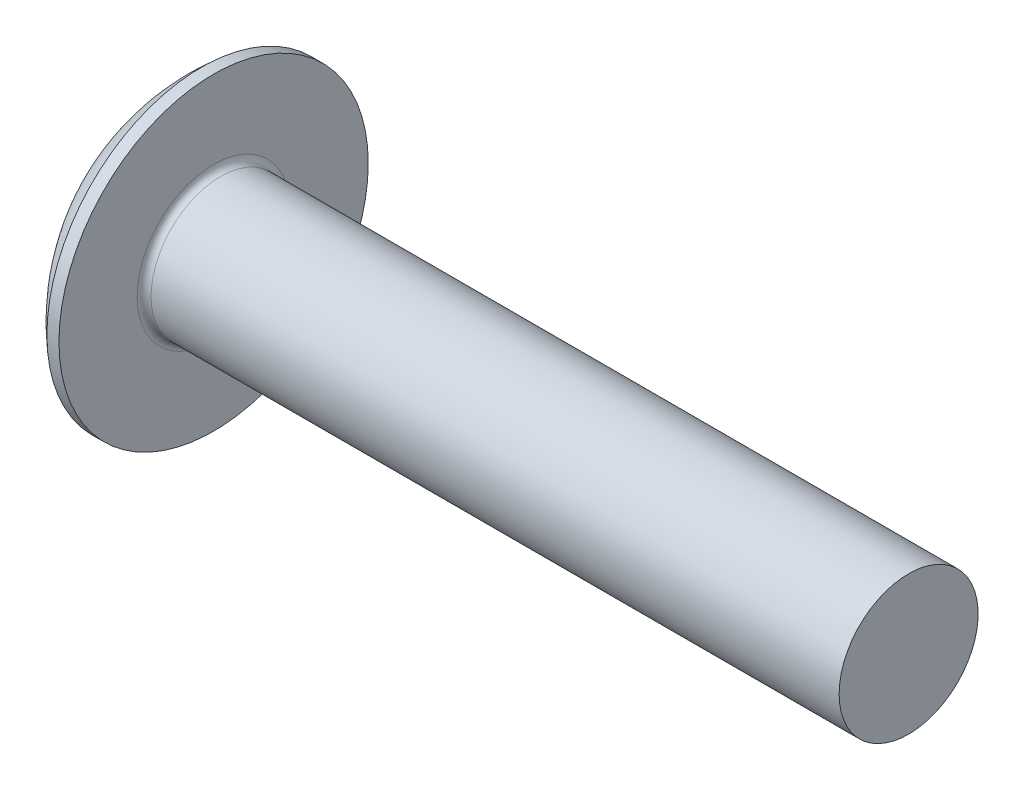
ISO-10303-21;
HEADER;
FILE_DESCRIPTION(('STEP AP214'),'2;1');
FILE_NAME('part.step','',(''),(''),'','','');
FILE_SCHEMA(('AUTOMOTIVE_DESIGN { 1 0 10303 214 1 1 1 1 }'));
ENDSEC;
DATA;
#1=APPLICATION_CONTEXT('core data for automotive mechanical design processes');
#2=APPLICATION_PROTOCOL_DEFINITION('international standard','automotive_design',2000,#1);
#3=PRODUCT_CONTEXT('',#1,'mechanical');
#4=PRODUCT('Part','Part','',(#3));
#5=PRODUCT_RELATED_PRODUCT_CATEGORY('part','',(#4));
#6=PRODUCT_DEFINITION_FORMATION('','',#4);
#7=PRODUCT_DEFINITION_CONTEXT('part definition',#1,'design');
#8=PRODUCT_DEFINITION('design','',#6,#7);
#9=PRODUCT_DEFINITION_SHAPE('','',#8);
#10=(LENGTH_UNIT() NAMED_UNIT(*) SI_UNIT(.MILLI.,.METRE.));
#11=(NAMED_UNIT(*) PLANE_ANGLE_UNIT() SI_UNIT($,.RADIAN.));
#12=(NAMED_UNIT(*) SI_UNIT($,.STERADIAN.) SOLID_ANGLE_UNIT());
#13=UNCERTAINTY_MEASURE_WITH_UNIT(LENGTH_MEASURE(1.E-05),#10,'distance_accuracy_value','');
#14=(GEOMETRIC_REPRESENTATION_CONTEXT(3) GLOBAL_UNCERTAINTY_ASSIGNED_CONTEXT((#13)) GLOBAL_UNIT_ASSIGNED_CONTEXT((#10,
#11,#12)) REPRESENTATION_CONTEXT('',''));
#15=CARTESIAN_POINT('',(0.,0.,0.));
#16=DIRECTION('',(0.,0.,1.));
#17=DIRECTION('',(1.,0.,0.));
#18=AXIS2_PLACEMENT_3D('',#15,#16,#17);
#19=CARTESIAN_POINT('',(11.7,0.,0.));
#20=DIRECTION('',(-1.,0.,0.));
#21=DIRECTION('',(0.,1.,0.));
#22=AXIS2_PLACEMENT_3D('',#19,#20,#21);
#23=SPHERICAL_SURFACE('',#22,11.7);
#24=CARTESIAN_POINT('',(4.10526498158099,0.,0.));
#25=DIRECTION('',(-1.,0.,0.));
#26=DIRECTION('',(0.,0.,1.));
#27=AXIS2_PLACEMENT_3D('',#24,#25,#26);
#28=CIRCLE('',#27,8.9);
#29=CARTESIAN_POINT('',(4.10526498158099,0.,8.9));
#30=VERTEX_POINT('',#29);
#31=EDGE_CURVE('E77',#30,#30,#28,.T.);
#32=ORIENTED_EDGE('',*,*,#31,.T.);
#33=EDGE_LOOP('',(#32));
#34=FACE_BOUND('',#33,.T.);
#35=CARTESIAN_POINT('',(2.4,0.,0.));
#36=DIRECTION('',(-1.,0.,0.));
#37=DIRECTION('',(0.,0.,1.));
#38=AXIS2_PLACEMENT_3D('',#35,#36,#37);
#39=CIRCLE('',#38,7.09929573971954);
#40=CARTESIAN_POINT('',(2.4,0.800000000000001,-7.05407683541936));
#41=VERTEX_POINT('',#40);
#42=CARTESIAN_POINT('',(2.4,-0.799999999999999,-7.05407683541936));
#43=VERTEX_POINT('',#42);
#44=EDGE_CURVE('E11',#41,#43,#39,.T.);
#45=ORIENTED_EDGE('',*,*,#44,.F.);
#46=CARTESIAN_POINT('',(11.7,0.8,0.));
#47=DIRECTION('',(0.,-1.,0.));
#48=DIRECTION('',(0.,0.,-1.));
#49=AXIS2_PLACEMENT_3D('',#46,#47,#48);
#50=CIRCLE('',#49,11.6726175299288);
#51=CARTESIAN_POINT('',(2.4,0.799999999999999,7.05407683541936));
#52=VERTEX_POINT('',#51);
#53=EDGE_CURVE('E37',#52,#41,#50,.T.);
#54=ORIENTED_EDGE('',*,*,#53,.F.);
#55=CARTESIAN_POINT('',(2.4,-0.800000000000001,7.05407683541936));
#56=VERTEX_POINT('',#55);
#57=EDGE_CURVE('E43',#56,#52,#39,.T.);
#58=ORIENTED_EDGE('',*,*,#57,.F.);
#59=CARTESIAN_POINT('',(11.7,-0.8,0.));
#60=DIRECTION('',(0.,1.,0.));
#61=DIRECTION('',(0.,0.,1.));
#62=AXIS2_PLACEMENT_3D('',#59,#60,#61);
#63=CIRCLE('',#62,11.6726175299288);
#64=EDGE_CURVE('E65',#43,#56,#63,.T.);
#65=ORIENTED_EDGE('',*,*,#64,.F.);
#66=EDGE_LOOP('',(#45,#54,#58,#65));
#67=FACE_BOUND('',#66,.T.);
#68=ADVANCED_FACE('F33',(#34,#67),#23,.T.);
#69=CARTESIAN_POINT('',(0.,0.,0.));
#70=DIRECTION('',(-1.,0.,0.));
#71=DIRECTION('',(0.,0.,1.));
#72=AXIS2_PLACEMENT_3D('',#69,#70,#71);
#73=CYLINDRICAL_SURFACE('',#72,8.9);
#74=ORIENTED_EDGE('',*,*,#31,.F.);
#75=EDGE_LOOP('',(#74));
#76=FACE_BOUND('',#75,.T.);
#77=CARTESIAN_POINT('',(4.8,0.,0.));
#78=DIRECTION('',(-1.,0.,0.));
#79=DIRECTION('',(0.,0.,1.));
#80=AXIS2_PLACEMENT_3D('',#77,#78,#79);
#81=CIRCLE('',#80,8.9);
#82=CARTESIAN_POINT('',(4.8,0.,8.9));
#83=VERTEX_POINT('',#82);
#84=EDGE_CURVE('E80',#83,#83,#81,.T.);
#85=ORIENTED_EDGE('',*,*,#84,.T.);
#86=EDGE_LOOP('',(#85));
#87=FACE_BOUND('',#86,.T.);
#88=ADVANCED_FACE('F96',(#76,#87),#73,.T.);
#89=CARTESIAN_POINT('',(4.8,8.9,0.));
#90=DIRECTION('',(-1.,0.,0.));
#91=DIRECTION('',(0.,0.,1.));
#92=AXIS2_PLACEMENT_3D('',#89,#90,#91);
#93=PLANE('',#92);
#94=CARTESIAN_POINT('',(4.8,0.,0.));
#95=DIRECTION('',(-1.,0.,0.));
#96=DIRECTION('',(0.,0.,1.));
#97=AXIS2_PLACEMENT_3D('',#94,#95,#96);
#98=CIRCLE('',#97,4.4);
#99=CARTESIAN_POINT('',(4.8,0.,4.4));
#100=VERTEX_POINT('',#99);
#101=EDGE_CURVE('E74',#100,#100,#98,.T.);
#102=ORIENTED_EDGE('',*,*,#101,.T.);
#103=EDGE_LOOP('',(#102));
#104=FACE_BOUND('',#103,.T.);
#105=ORIENTED_EDGE('',*,*,#84,.F.);
#106=EDGE_LOOP('',(#105));
#107=FACE_BOUND('',#106,.T.);
#108=ADVANCED_FACE('F101',(#104,#107),#93,.F.);
#109=CARTESIAN_POINT('',(0.,0.,0.));
#110=DIRECTION('',(-1.,0.,0.));
#111=DIRECTION('',(0.,0.,1.));
#112=AXIS2_PLACEMENT_3D('',#109,#110,#111);
#113=CYLINDRICAL_SURFACE('',#112,4.);
#114=CARTESIAN_POINT('',(5.2,0.,0.));
#115=DIRECTION('',(-1.,0.,0.));
#116=DIRECTION('',(0.,0.,1.));
#117=AXIS2_PLACEMENT_3D('',#114,#115,#116);
#118=CIRCLE('',#117,4.);
#119=CARTESIAN_POINT('',(5.2,0.,4.));
#120=VERTEX_POINT('',#119);
#121=EDGE_CURVE('E70',#120,#120,#118,.F.);
#122=ORIENTED_EDGE('',*,*,#121,.T.);
#123=EDGE_LOOP('',(#122));
#124=FACE_BOUND('',#123,.T.);
#125=CARTESIAN_POINT('',(44.8,0.,0.));
#126=DIRECTION('',(-1.,0.,0.));
#127=DIRECTION('',(0.,0.,1.));
#128=AXIS2_PLACEMENT_3D('',#125,#126,#127);
#129=CIRCLE('',#128,4.);
#130=CARTESIAN_POINT('',(44.8,0.,4.));
#131=VERTEX_POINT('',#130);
#132=EDGE_CURVE('E83',#131,#131,#129,.T.);
#133=ORIENTED_EDGE('',*,*,#132,.T.);
#134=EDGE_LOOP('',(#133));
#135=FACE_BOUND('',#134,.T.);
#136=ADVANCED_FACE('F107',(#124,#135),#113,.T.);
#137=CARTESIAN_POINT('',(44.8,4.,0.));
#138=DIRECTION('',(-1.,0.,0.));
#139=DIRECTION('',(0.,0.,1.));
#140=AXIS2_PLACEMENT_3D('',#137,#138,#139);
#141=PLANE('',#140);
#142=ORIENTED_EDGE('',*,*,#132,.F.);
#143=EDGE_LOOP('',(#142));
#144=FACE_BOUND('',#143,.T.);
#145=ADVANCED_FACE('F111',(#144),#141,.F.);
#146=CARTESIAN_POINT('',(5.2,0.,0.));
#147=DIRECTION('',(-1.,0.,0.));
#148=DIRECTION('',(0.,0.,1.));
#149=AXIS2_PLACEMENT_3D('',#146,#147,#148);
#150=TOROIDAL_SURFACE('',#149,4.4,0.4);
#151=ORIENTED_EDGE('',*,*,#121,.F.);
#152=EDGE_LOOP('',(#151));
#153=FACE_BOUND('',#152,.T.);
#154=ORIENTED_EDGE('',*,*,#101,.F.);
#155=EDGE_LOOP('',(#154));
#156=FACE_BOUND('',#155,.T.);
#157=ADVANCED_FACE('F35',(#153,#156),#150,.F.);
#158=CARTESIAN_POINT('',(2.4,0.800000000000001,-8.9));
#159=DIRECTION('',(0.,-1.,0.));
#160=DIRECTION('',(0.,0.,-1.));
#161=AXIS2_PLACEMENT_3D('',#158,#159,#160);
#162=PLANE('',#161);
#163=ORIENTED_EDGE('',*,*,#53,.T.);
#164=DIRECTION('',(0.,0.,1.));
#165=VECTOR('',#164,1.);
#166=CARTESIAN_POINT('',(2.4,0.800000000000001,-8.9));
#167=LINE('',#166,#165);
#168=EDGE_CURVE('E62',#41,#52,#167,.T.);
#169=ORIENTED_EDGE('',*,*,#168,.T.);
#170=EDGE_LOOP('',(#163,#169));
#171=FACE_BOUND('',#170,.T.);
#172=ADVANCED_FACE('F61',(#171),#162,.T.);
#173=CARTESIAN_POINT('',(2.4,-0.799999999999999,-8.9));
#174=DIRECTION('',(0.,1.,0.));
#175=DIRECTION('',(0.,0.,1.));
#176=AXIS2_PLACEMENT_3D('',#173,#174,#175);
#177=PLANE('',#176);
#178=ORIENTED_EDGE('',*,*,#64,.T.);
#179=DIRECTION('',(0.,0.,-1.));
#180=VECTOR('',#179,1.);
#181=CARTESIAN_POINT('',(2.4,-0.799999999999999,-8.9));
#182=LINE('',#181,#180);
#183=EDGE_CURVE('E49',#56,#43,#182,.T.);
#184=ORIENTED_EDGE('',*,*,#183,.T.);
#185=EDGE_LOOP('',(#178,#184));
#186=FACE_BOUND('',#185,.T.);
#187=ADVANCED_FACE('F86',(#186),#177,.T.);
#188=CARTESIAN_POINT('',(2.4,-0.799999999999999,-8.9));
#189=DIRECTION('',(-1.,0.,0.));
#190=DIRECTION('',(0.,0.,1.));
#191=AXIS2_PLACEMENT_3D('',#188,#189,#190);
#192=PLANE('',#191);
#193=ORIENTED_EDGE('',*,*,#44,.T.);
#194=ORIENTED_EDGE('',*,*,#183,.F.);
#195=ORIENTED_EDGE('',*,*,#57,.T.);
#196=ORIENTED_EDGE('',*,*,#168,.F.);
#197=EDGE_LOOP('',(#193,#194,#195,#196));
#198=FACE_BOUND('',#197,.T.);
#199=ADVANCED_FACE('F66',(#198),#192,.T.);
#200=CLOSED_SHELL('',(#68,#88,#108,#136,#145,#157,#172,#187,#199));
#201=MANIFOLD_SOLID_BREP('B2',#200);
#202=ADVANCED_BREP_SHAPE_REPRESENTATION('',(#18,#201),#14);
#203=SHAPE_DEFINITION_REPRESENTATION(#9,#202);
ENDSEC;
END-ISO-10303-21;
